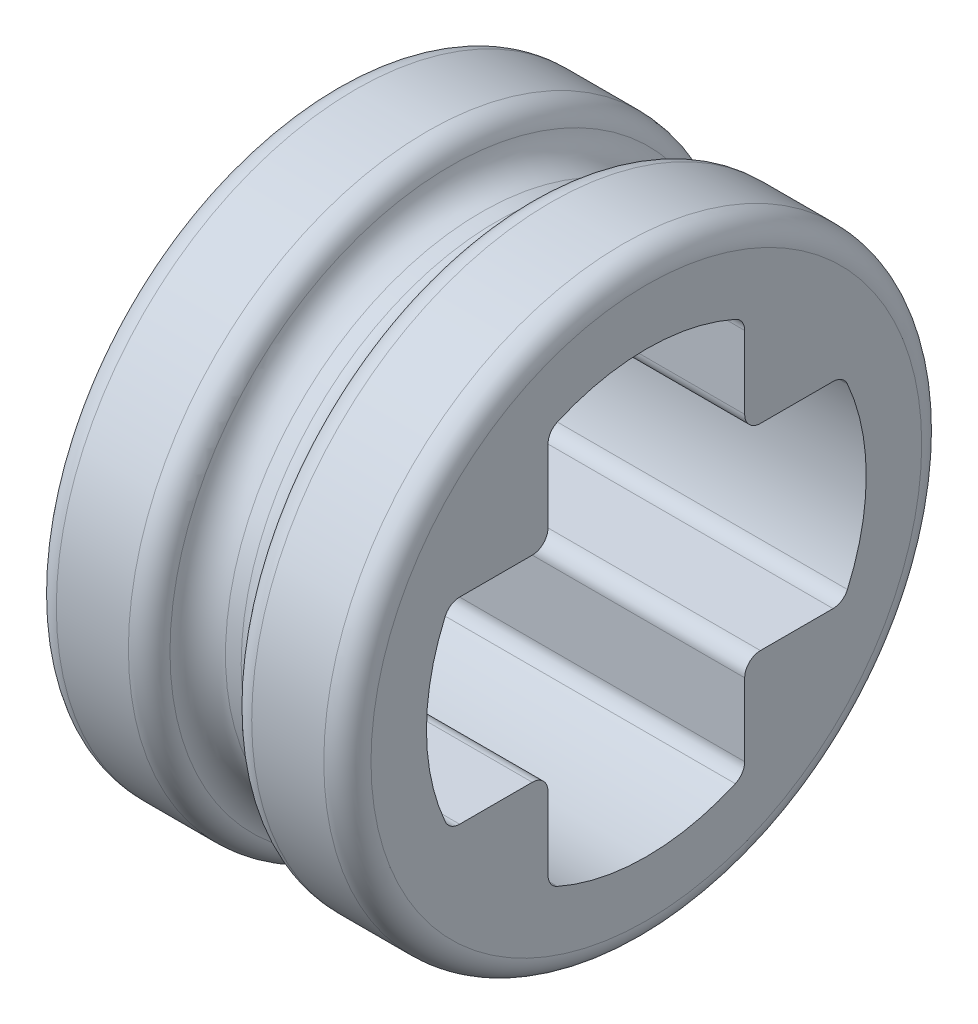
from build123d import *

# Parameters (mm, degrees)
FILLET1_R          = 0.4
CUT_EXTRUDE1_DEPTH = 7.69925369
FILLET2_R          = 0.2
FILLET3_R          = 0.3
SKETCH3_R          = 2.8
CUT_EXTRUDE2_DEPTH = 0.05


with BuildPart() as part:
    # Sketch1 → Revolve1 (revolve)
    with BuildSketch(Plane.XY, mode=Mode.PRIVATE) as revolve1_sk:
        Polygon((2, 0), (-2, 0), (-2, 3.8), (-0.5, 3.8), (-0.5, 3.25), (0.5, 3.25), (0.5, 3.8), (2, 3.8), align=None)
    revolve(revolve1_sk.sketch.rotate(Axis((2, 0, 0), (-1, 0, 0)), 90), axis=Axis((2, 0, 0), (-1, 0, 0)))

    # Fillet1
    fillet1_edges = [part.edges().sort_by_distance(p)[0] for p in [
        (-0.5, 0, 3.25),
        (0.5, 0, 3.25),
    ]]
    fillet(fillet1_edges, radius=FILLET1_R)

    # Sketch2 → Cut-Extrude1 (cut, through all)
    with BuildSketch(Plane.ZY.offset(2)):
        with BuildLine():
            Line((-1.25, 2.5), (-1.25, 1.25))
            Line((-1.25, 1.25), (-2.5, 1.25))
            ThreePointArc((-2.5, 1.25), (-2.795084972, 0), (-2.5, -1.25))
            Line((-2.5, -1.25), (-1.25, -1.25))
            Line((-1.25, -1.25), (-1.25, -2.5))
            ThreePointArc((-1.25, -2.5), (0, -2.795084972), (1.25, -2.5))
            Line((1.25, -2.5), (1.25, -1.25))
            Line((1.25, -1.25), (2.5, -1.25))
            ThreePointArc((2.5, -1.25), (2.795084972, 0), (2.5, 1.25))
            Line((2.5, 1.25), (1.25, 1.25))
            Line((1.25, 1.25), (1.25, 2.5))
            ThreePointArc((1.25, 2.5), (0, 2.795084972), (-1.25, 2.5))
        make_face()
    extrude(amount=-CUT_EXTRUDE1_DEPTH, mode=Mode.SUBTRACT)

    # Fillet2
    fillet2_edges = [part.edges().sort_by_distance(p)[0] for p in [
        (0, 2.5, -1.25),
        (0, 2.5, 1.25),
        (0, 1.25, 1.25),
        (0, 1.25, 2.5),
        (0, -1.25, 2.5),
        (0, -1.25, 1.25),
        (0, -2.5, 1.25),
        (0, -2.5, -1.25),
        (0, -1.25, -1.25),
        (0, -1.25, -2.5),
        (0, 1.25, -2.5),
        (0, 1.25, -1.25),
    ]]
    fillet(fillet2_edges, radius=FILLET2_R)

    # Fillet3
    fillet3_edges = [part.edges().sort_by_distance(p)[0] for p in [
        (2, 0, 3.8),
        (0.5, 0, 3.8),
        (-0.5, 0, 3.8),
        (-2, 0, 3.8),
    ]]
    fillet(fillet3_edges, radius=FILLET3_R)

    # Sketch3 → Cut-Extrude2 (cut)
    with BuildSketch(Plane.ZY.offset(2)):
        Circle(SKETCH3_R)
    extrude(amount=-CUT_EXTRUDE2_DEPTH, mode=Mode.SUBTRACT)


solid = part.part
